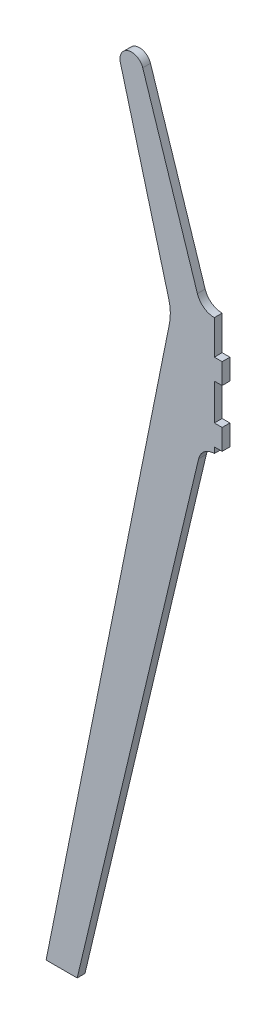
from build123d import *

# Parameters (mm, degrees)
SALIENTE_EXTRUIR1_DEPTH = 7.5


with BuildPart() as part:
    # Croquis1 → Saliente-Extruir1 (new, symmetric)
    with BuildSketch(Plane.XY):
        with BuildLine():
            Line((-332.179186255, -1195.845070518), (-272.179186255, -1195.845070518))
            Line((-272.179186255, -1195.845070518), (-37.909982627, -210.994843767))
            ThreePointArc((-37.909982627, -210.994843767), (-26.877547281, -193.700932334), (-7.5, -186.970058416))
            Line((-7.5, -186.970058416), (-7.5, -175.900058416))
            Line((-7.5, -175.900058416), (7.5, -175.900058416))
            Line((7.5, -175.900058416), (7.5, -135.900058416))
            Line((7.5, -135.900058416), (-7.5, -135.900058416))
            Line((-7.5, -135.900058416), (-7.5, -65.900058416))
            Line((-7.5, -65.900058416), (7.5, -65.900058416))
            Line((7.5, -65.900058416), (7.5, -25.900058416))
            Line((7.5, -25.900058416), (-7.5, -25.900058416))
            Line((-7.5, -25.900058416), (-7.5, 40.169941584))
            ThreePointArc((-7.5, 40.169941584), (-27.726624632, 46.741970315), (-40.227366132, 63.947764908))
            Line((-40.227366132, 63.947764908), (-145.714078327, 388.60248242))
            ThreePointArc((-145.714078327, 388.60248242), (-173.5127211, 403.2280559), (-188.860966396, 375.821791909))
            Line((-188.860966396, 375.821791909), (-95.514662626, 27.448643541))
            ThreePointArc((-95.514662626, 27.448643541), (-92.492880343, 6.997250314), (-94.217514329, -13.604115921))
            Line((-94.217514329, -13.604115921), (-332.179186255, -1195.845070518))
        make_face()
    extrude(amount=SALIENTE_EXTRUIR1_DEPTH, both=True)


solid = part.part
